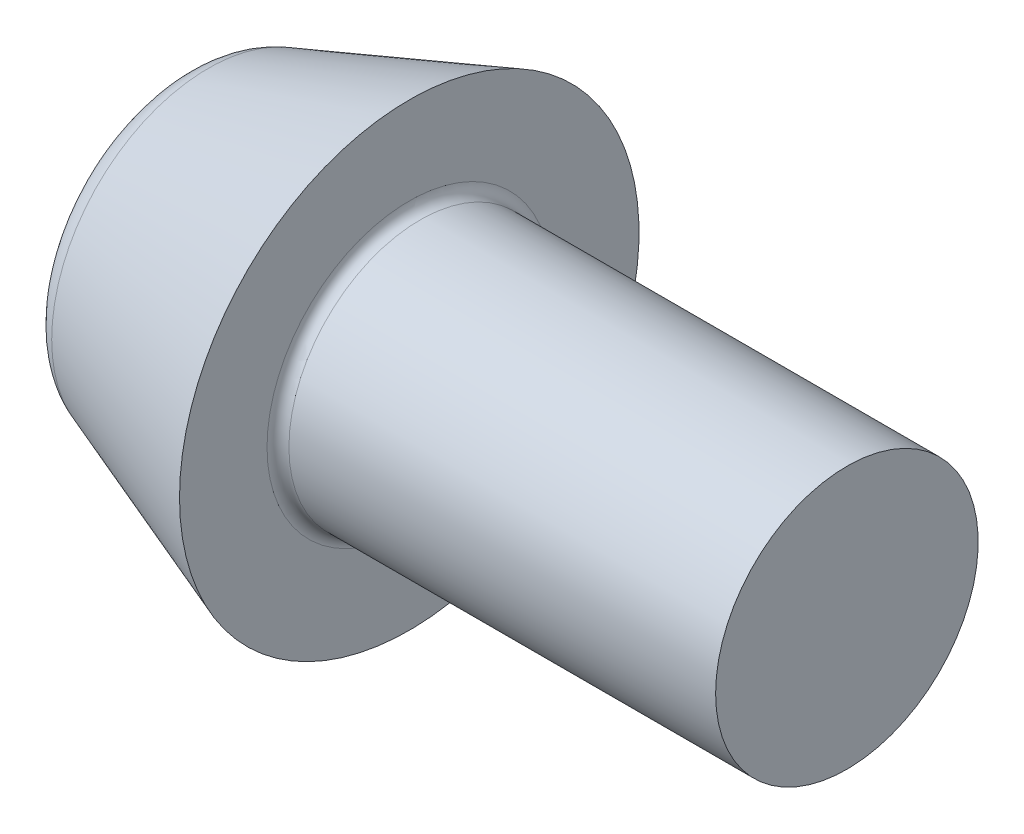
from build123d import *

# Parameters (mm, degrees)
FILLET1_R = 0.5
FILLET2_R = 2


with BuildPart() as part:
    # Sketch1 → Base-Revolve (revolve)
    with BuildSketch(Plane.XY, mode=Mode.PRIVATE) as base_revolve_sk:
        Polygon((0, 0), (30.5, 0), (30.5, 6), (10.5, 6), (10.5, 10.5), (0, 6.67831254), align=None)
    revolve(base_revolve_sk.sketch.rotate(Axis((-26.488571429, 0, 0), (1, 0, 0)), 90), axis=Axis((-26.488571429, 0, 0), (1, 0, 0)))

    # Fillet1
    fillet1_edges = [part.edges().sort_by_distance(p)[0] for p in [
        (10.5, 0, -6),
    ]]
    fillet(fillet1_edges, radius=FILLET1_R)

    # Fillet2
    fillet2_edges = [part.edges().sort_by_distance(p)[0] for p in [
        (0, 0, -6.67831254),
    ]]
    fillet(fillet2_edges, radius=FILLET2_R)


solid = part.part
